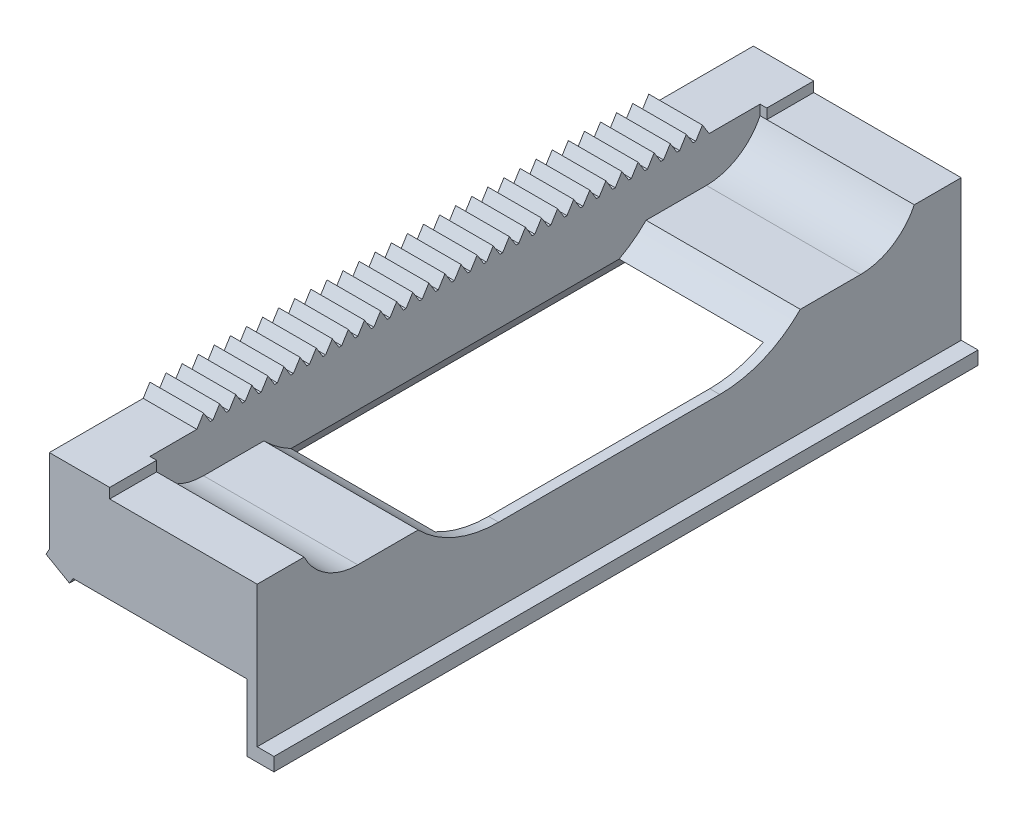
from build123d import *

# Parameters (mm, degrees)
BOSS_EXTRU_1_DEPTH      = 105
ENL_V_MAT_EXTRU_1_DEPTH = 23
ESQUISSE3_W             = 26
ESQUISSE3_H             = 89
ENL_V_MAT_EXTRU_2_DEPTH = 5
ESQUISSE5_W             = 100
ESQUISSE5_H             = 9.868243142
ENL_V_MAT_EXTRU_4_DEPTH = 5
BOSS_EXTRU_4_DEPTH      = 105
BOSS_EXTRU_6_DEPTH      = 8


with BuildPart() as part:
    # Esquisse1 → Boss.-Extru.1 (new body)
    with BuildSketch(Plane.XY):
        Polygon((0, 0), (26, 0), (26, -10), (30, -10), (30, -8), (27.5, -8), (27.5, 13), (5.5, 13), (5.5, 14.5), (-3.5, 14.5), (-3.5, 2), (-3.996138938, 1.131756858), (-0.496138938, -0.868243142), align=None)
    extrude(amount=BOSS_EXTRU_1_DEPTH)

    # Esquisse2 → Enl_v. mat.-Extru.1 (cut)
    with BuildSketch(Plane(origin=(27.5, 0, 0), x_dir=(0, 0, -1), z_dir=(1, 0, 0))):
        with BuildLine():
            Line((-69, 3), (-36, 3))
            ThreePointArc((-36, 3), (-29.5, 4.3), (-24, 8))
            Line((-24, 8), (-15, 8))
            ThreePointArc((-15, 8), (-10.283009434, 9.352815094), (-7, 13))
            Line((-7, 13), (-7, 21.877844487))
            Line((-7, 21.877844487), (-98, 21.877844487))
            Line((-98, 21.877844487), (-98, 13))
            ThreePointArc((-98, 13), (-94.716990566, 9.352815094), (-90, 8))
            Line((-90, 8), (-81, 8))
            ThreePointArc((-81, 8), (-75.5, 4.3), (-69, 3))
        make_face()
    extrude(amount=-ENL_V_MAT_EXTRU_1_DEPTH, mode=Mode.SUBTRACT)

    # Esquisse3 → Enl_v. mat.-Extru.2 (cut)
    with BuildSketch(Plane.XZ):
        with Locations((13, 52.5)):
            Rectangle(ESQUISSE3_W, ESQUISSE3_H)
    extrude(amount=-ENL_V_MAT_EXTRU_2_DEPTH, mode=Mode.SUBTRACT)

    # Esquisse5 → Enl_v. mat.-Extru.4 (cut)
    with BuildSketch(Plane.ZY.offset(3.5)):
        with Locations((52.5, 7.065878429)):
            Rectangle(ESQUISSE5_W, ESQUISSE5_H)
    extrude(amount=-ENL_V_MAT_EXTRU_4_DEPTH, mode=Mode.SUBTRACT)

    # Esquisse4 → Boss.-Extru.4 (add, through all)
    with BuildSketch(Plane.XY.offset(105)):
        Polygon((-3.996138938, 1.131756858), (-0.496138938, -0.868243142), (2.962208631, 4.605893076), (0.277944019, 6.675421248), align=None)
    extrude(amount=-BOSS_EXTRU_4_DEPTH)

    # Esquisse7 → Boss.-Extru.6 (add)
    with BuildSketch(Plane.ZY.offset(3.5)):
        Polygon((84.2, 14.5), (86.2, 14.5), (85.2, 16.1), align=None)
        Polygon((86.6, 14.5), (88.6, 14.5), (87.6, 16.1), align=None)
        Polygon((89, 14.5), (91, 14.5), (90, 16.1), align=None)
        Polygon((69.8, 14.5), (71.8, 14.5), (70.8, 16.1), align=None)
        Polygon((72.2, 14.5), (74.2, 14.5), (73.2, 16.1), align=None)
        Polygon((74.6, 14.5), (76.6, 14.5), (75.6, 16.1), align=None)
        Polygon((77, 14.5), (79, 14.5), (78, 16.1), align=None)
        Polygon((79.4, 14.5), (81.4, 14.5), (80.4, 16.1), align=None)
        Polygon((82.8, 16.1), (81.8, 14.5), (83.8, 14.5), align=None)
        Polygon((57.8, 14.5), (59.8, 14.5), (58.8, 16.1), align=None)
        Polygon((60.2, 14.5), (62.2, 14.5), (61.2, 16.1), align=None)
        Polygon((62.6, 14.5), (64.6, 14.5), (63.6, 16.1), align=None)
        Polygon((65, 14.5), (67, 14.5), (66, 16.1), align=None)
        Polygon((67.4, 14.5), (69.4, 14.5), (68.4, 16.1), align=None)
        Polygon((45.8, 14.5), (47.8, 14.5), (46.8, 16.1), align=None)
        Polygon((48.2, 14.5), (50.2, 14.5), (49.2, 16.1), align=None)
        Polygon((50.6, 14.5), (52.6, 14.5), (51.6, 16.1), align=None)
        Polygon((53, 14.5), (55, 14.5), (54, 16.1), align=None)
        Polygon((56.4, 16.1), (55.4, 14.5), (57.4, 14.5), align=None)
        Polygon((31.4, 14.5), (33.4, 14.5), (32.4, 16.1), align=None)
        Polygon((33.8, 14.5), (35.8, 14.5), (34.8, 16.1), align=None)
        Polygon((36.2, 14.5), (38.2, 14.5), (37.2, 16.1), align=None)
        Polygon((38.6, 14.5), (40.6, 14.5), (39.6, 16.1), align=None)
        Polygon((41, 14.5), (43, 14.5), (42, 16.1), align=None)
        Polygon((44.4, 16.1), (43.4, 14.5), (45.4, 14.5), align=None)
        Polygon((19.4, 14.5), (21.4, 14.5), (20.4, 16.1), align=None)
        Polygon((21.8, 14.5), (23.8, 14.5), (22.8, 16.1), align=None)
        Polygon((24.2, 14.5), (26.2, 14.5), (25.2, 16.1), align=None)
        Polygon((26.6, 14.5), (28.6, 14.5), (27.6, 16.1), align=None)
        Polygon((29, 14.5), (31, 14.5), (30, 16.1), align=None)
        Polygon((14.6, 14.5), (16.6, 14.5), (15.6, 16.1), align=None)
        Polygon((18, 16.1), (17, 14.5), (19, 14.5), align=None)
    extrude(amount=-BOSS_EXTRU_6_DEPTH)


solid = part.part
